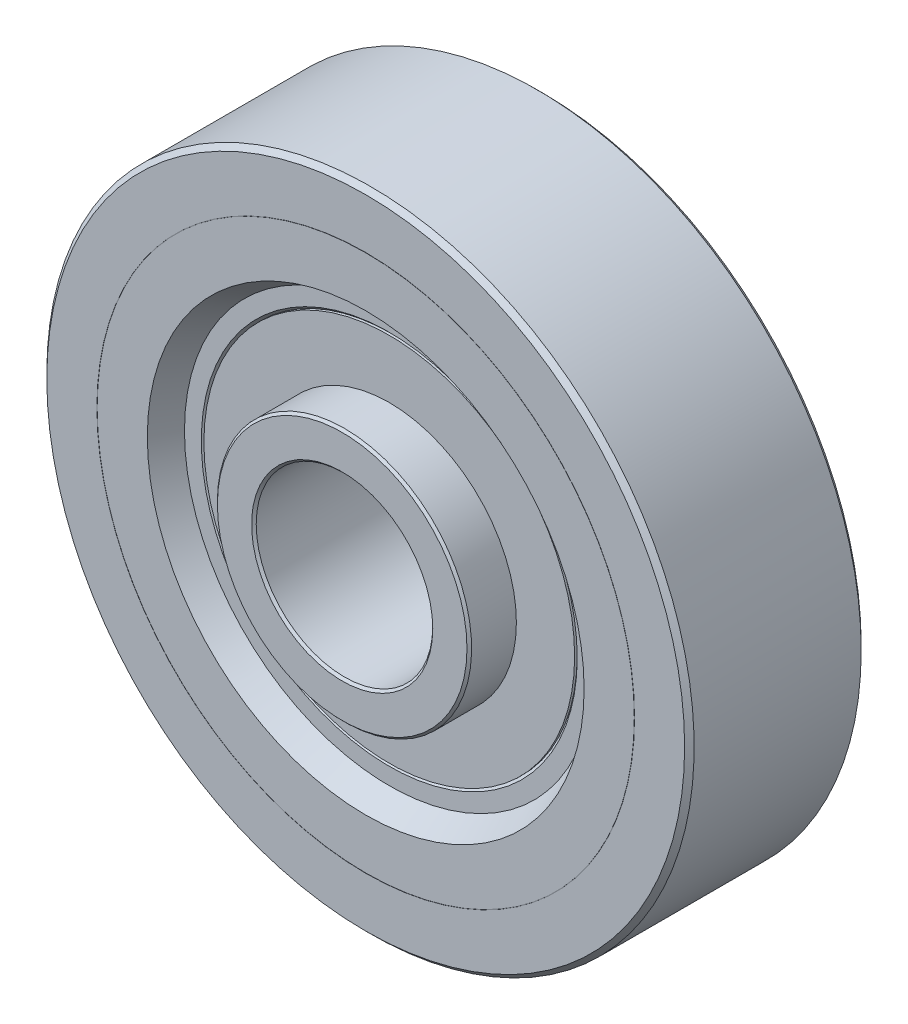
ISO-10303-21;
HEADER;
FILE_DESCRIPTION(('STEP AP214'),'2;1');
FILE_NAME('part.step','',(''),(''),'','','');
FILE_SCHEMA(('AUTOMOTIVE_DESIGN { 1 0 10303 214 1 1 1 1 }'));
ENDSEC;
DATA;
#1=APPLICATION_CONTEXT('core data for automotive mechanical design processes');
#2=APPLICATION_PROTOCOL_DEFINITION('international standard','automotive_design',2000,#1);
#3=PRODUCT_CONTEXT('',#1,'mechanical');
#4=PRODUCT('Part','Part','',(#3));
#5=PRODUCT_RELATED_PRODUCT_CATEGORY('part','',(#4));
#6=PRODUCT_DEFINITION_FORMATION('','',#4);
#7=PRODUCT_DEFINITION_CONTEXT('part definition',#1,'design');
#8=PRODUCT_DEFINITION('design','',#6,#7);
#9=PRODUCT_DEFINITION_SHAPE('','',#8);
#10=(LENGTH_UNIT() NAMED_UNIT(*) SI_UNIT(.MILLI.,.METRE.));
#11=(NAMED_UNIT(*) PLANE_ANGLE_UNIT() SI_UNIT($,.RADIAN.));
#12=(NAMED_UNIT(*) SI_UNIT($,.STERADIAN.) SOLID_ANGLE_UNIT());
#13=UNCERTAINTY_MEASURE_WITH_UNIT(LENGTH_MEASURE(1.E-05),#10,'distance_accuracy_value','');
#14=(GEOMETRIC_REPRESENTATION_CONTEXT(3) GLOBAL_UNCERTAINTY_ASSIGNED_CONTEXT((#13)) GLOBAL_UNIT_ASSIGNED_CONTEXT((#10,
#11,#12)) REPRESENTATION_CONTEXT('',''));
#15=CARTESIAN_POINT('',(0.,0.,0.));
#16=DIRECTION('',(0.,0.,1.));
#17=DIRECTION('',(1.,0.,0.));
#18=AXIS2_PLACEMENT_3D('',#15,#16,#17);
#19=CARTESIAN_POINT('',(0.,13.275,5.5));
#20=DIRECTION('',(0.,0.,1.));
#21=DIRECTION('',(1.,0.,0.));
#22=AXIS2_PLACEMENT_3D('',#19,#20,#21);
#23=PLANE('',#22);
#24=CARTESIAN_POINT('',(0.,0.,5.5));
#25=DIRECTION('',(0.,0.,-1.));
#26=DIRECTION('',(-1.,0.,0.));
#27=AXIS2_PLACEMENT_3D('',#24,#25,#26);
#28=CIRCLE('',#27,15.75);
#29=CARTESIAN_POINT('',(-15.75,0.,5.5));
#30=VERTEX_POINT('',#29);
#31=EDGE_CURVE('E44',#30,#30,#28,.T.);
#32=ORIENTED_EDGE('',*,*,#31,.F.);
#33=EDGE_LOOP('',(#32));
#34=FACE_BOUND('',#33,.T.);
#35=CARTESIAN_POINT('',(0.,0.,5.5));
#36=DIRECTION('',(0.,0.,1.));
#37=DIRECTION('',(1.,0.,0.));
#38=AXIS2_PLACEMENT_3D('',#35,#36,#37);
#39=CIRCLE('',#38,10.8);
#40=CARTESIAN_POINT('',(10.8,0.,5.5));
#41=VERTEX_POINT('',#40);
#42=EDGE_CURVE('E8',#41,#41,#39,.F.);
#43=ORIENTED_EDGE('',*,*,#42,.T.);
#44=EDGE_LOOP('',(#43));
#45=FACE_BOUND('',#44,.T.);
#46=ADVANCED_FACE('F12',(#34,#45),#23,.T.);
#47=CARTESIAN_POINT('',(0.,0.,4.8125));
#48=DIRECTION('',(0.,0.,-1.));
#49=DIRECTION('',(-1.,0.,0.));
#50=AXIS2_PLACEMENT_3D('',#47,#48,#49);
#51=CYLINDRICAL_SURFACE('',#50,15.75);
#52=ORIENTED_EDGE('',*,*,#31,.T.);
#53=EDGE_LOOP('',(#52));
#54=FACE_BOUND('',#53,.T.);
#55=CARTESIAN_POINT('',(0.,0.,5.28));
#56=DIRECTION('',(0.,0.,1.));
#57=DIRECTION('',(0.,1.,0.));
#58=AXIS2_PLACEMENT_3D('',#55,#56,#57);
#59=CIRCLE('',#58,15.75);
#60=CARTESIAN_POINT('',(0.,15.75,5.28));
#61=VERTEX_POINT('',#60);
#62=EDGE_CURVE('E41',#61,#61,#59,.T.);
#63=ORIENTED_EDGE('',*,*,#62,.T.);
#64=EDGE_LOOP('',(#63));
#65=FACE_BOUND('',#64,.T.);
#66=ADVANCED_FACE('F192',(#54,#65),#51,.T.);
#67=CARTESIAN_POINT('',(0.,0.,5.5));
#68=DIRECTION('',(0.,0.,1.));
#69=DIRECTION('',(1.,0.,0.));
#70=AXIS2_PLACEMENT_3D('',#67,#68,#69);
#71=CONICAL_SURFACE('',#70,15.97,0.78539816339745);
#72=ORIENTED_EDGE('',*,*,#62,.F.);
#73=EDGE_LOOP('',(#72));
#74=FACE_BOUND('',#73,.T.);
#75=CARTESIAN_POINT('',(0.,0.,5.5));
#76=DIRECTION('',(0.,0.,1.));
#77=DIRECTION('',(1.,0.,0.));
#78=AXIS2_PLACEMENT_3D('',#75,#76,#77);
#79=CIRCLE('',#78,15.97);
#80=CARTESIAN_POINT('',(15.97,0.,5.5));
#81=VERTEX_POINT('',#80);
#82=EDGE_CURVE('E40',#81,#81,#79,.F.);
#83=ORIENTED_EDGE('',*,*,#82,.F.);
#84=EDGE_LOOP('',(#83));
#85=FACE_BOUND('',#84,.T.);
#86=ADVANCED_FACE('F187',(#74,#85),#71,.F.);
#87=CARTESIAN_POINT('',(0.,16.685,5.5));
#88=DIRECTION('',(0.,0.,1.));
#89=DIRECTION('',(1.,0.,0.));
#90=AXIS2_PLACEMENT_3D('',#87,#88,#89);
#91=PLANE('',#90);
#92=CARTESIAN_POINT('',(0.,0.,5.5));
#93=DIRECTION('',(0.,0.,1.));
#94=DIRECTION('',(1.,0.,0.));
#95=AXIS2_PLACEMENT_3D('',#92,#93,#94);
#96=CIRCLE('',#95,17.4);
#97=CARTESIAN_POINT('',(17.4,0.,5.5));
#98=VERTEX_POINT('',#97);
#99=EDGE_CURVE('E83',#98,#98,#96,.T.);
#100=ORIENTED_EDGE('',*,*,#99,.T.);
#101=EDGE_LOOP('',(#100));
#102=FACE_BOUND('',#101,.T.);
#103=ORIENTED_EDGE('',*,*,#82,.T.);
#104=EDGE_LOOP('',(#103));
#105=FACE_BOUND('',#104,.T.);
#106=ADVANCED_FACE('F181',(#102,#105),#91,.T.);
#107=CARTESIAN_POINT('',(0.,0.,7.5));
#108=DIRECTION('',(0.,0.,1.));
#109=DIRECTION('',(1.,0.,0.));
#110=AXIS2_PLACEMENT_3D('',#107,#108,#109);
#111=CONICAL_SURFACE('',#110,18.5547005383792,0.523598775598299);
#112=ORIENTED_EDGE('',*,*,#99,.F.);
#113=EDGE_LOOP('',(#112));
#114=FACE_BOUND('',#113,.T.);
#115=CARTESIAN_POINT('',(0.,0.,7.5));
#116=DIRECTION('',(0.,0.,1.));
#117=DIRECTION('',(1.,0.,0.));
#118=AXIS2_PLACEMENT_3D('',#115,#116,#117);
#119=CIRCLE('',#118,18.5547005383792);
#120=CARTESIAN_POINT('',(18.5547005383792,0.,7.5));
#121=VERTEX_POINT('',#120);
#122=EDGE_CURVE('E77',#121,#121,#119,.F.);
#123=ORIENTED_EDGE('',*,*,#122,.F.);
#124=EDGE_LOOP('',(#123));
#125=FACE_BOUND('',#124,.T.);
#126=ADVANCED_FACE('F174',(#114,#125),#111,.F.);
#127=CARTESIAN_POINT('',(0.,20.6866002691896,7.5));
#128=DIRECTION('',(0.,0.,1.));
#129=DIRECTION('',(1.,0.,0.));
#130=AXIS2_PLACEMENT_3D('',#127,#128,#129);
#131=PLANE('',#130);
#132=CARTESIAN_POINT('',(0.,0.,7.5));
#133=DIRECTION('',(0.,0.,-1.));
#134=DIRECTION('',(-1.,0.,0.));
#135=AXIS2_PLACEMENT_3D('',#132,#133,#134);
#136=CIRCLE('',#135,22.8185);
#137=CARTESIAN_POINT('',(-22.8185,0.,7.5));
#138=VERTEX_POINT('',#137);
#139=EDGE_CURVE('E71',#138,#138,#136,.T.);
#140=ORIENTED_EDGE('',*,*,#139,.F.);
#141=EDGE_LOOP('',(#140));
#142=FACE_BOUND('',#141,.T.);
#143=ORIENTED_EDGE('',*,*,#122,.T.);
#144=EDGE_LOOP('',(#143));
#145=FACE_BOUND('',#144,.T.);
#146=ADVANCED_FACE('F166',(#142,#145),#131,.T.);
#147=CARTESIAN_POINT('',(0.,0.,7.49));
#148=DIRECTION('',(0.,0.,-1.));
#149=DIRECTION('',(-1.,0.,0.));
#150=AXIS2_PLACEMENT_3D('',#147,#148,#149);
#151=CYLINDRICAL_SURFACE('',#150,22.8185);
#152=ORIENTED_EDGE('',*,*,#139,.T.);
#153=EDGE_LOOP('',(#152));
#154=FACE_BOUND('',#153,.T.);
#155=CARTESIAN_POINT('',(0.,0.,7.48));
#156=DIRECTION('',(0.,0.,-1.));
#157=DIRECTION('',(-1.,0.,0.));
#158=AXIS2_PLACEMENT_3D('',#155,#156,#157);
#159=CIRCLE('',#158,22.8185);
#160=CARTESIAN_POINT('',(-22.8185,0.,7.48));
#161=VERTEX_POINT('',#160);
#162=EDGE_CURVE('E65',#161,#161,#159,.T.);
#163=ORIENTED_EDGE('',*,*,#162,.F.);
#164=EDGE_LOOP('',(#163));
#165=FACE_BOUND('',#164,.T.);
#166=ADVANCED_FACE('F158',(#154,#165),#151,.T.);
#167=CARTESIAN_POINT('',(0.,22.8285,7.48));
#168=DIRECTION('',(0.,0.,1.));
#169=DIRECTION('',(1.,0.,0.));
#170=AXIS2_PLACEMENT_3D('',#167,#168,#169);
#171=PLANE('',#170);
#172=CARTESIAN_POINT('',(0.,0.,7.48));
#173=DIRECTION('',(0.,0.,-1.));
#174=DIRECTION('',(-1.,0.,0.));
#175=AXIS2_PLACEMENT_3D('',#172,#173,#174);
#176=CIRCLE('',#175,22.8385);
#177=CARTESIAN_POINT('',(-22.8385,0.,7.48));
#178=VERTEX_POINT('',#177);
#179=EDGE_CURVE('E59',#178,#178,#176,.F.);
#180=ORIENTED_EDGE('',*,*,#179,.T.);
#181=EDGE_LOOP('',(#180));
#182=FACE_BOUND('',#181,.T.);
#183=ORIENTED_EDGE('',*,*,#162,.T.);
#184=EDGE_LOOP('',(#183));
#185=FACE_BOUND('',#184,.T.);
#186=ADVANCED_FACE('F150',(#182,#185),#171,.T.);
#187=CARTESIAN_POINT('',(0.,0.,7.49));
#188=DIRECTION('',(0.,0.,-1.));
#189=DIRECTION('',(-1.,0.,0.));
#190=AXIS2_PLACEMENT_3D('',#187,#188,#189);
#191=CYLINDRICAL_SURFACE('',#190,22.8385);
#192=ORIENTED_EDGE('',*,*,#179,.F.);
#193=EDGE_LOOP('',(#192));
#194=FACE_BOUND('',#193,.T.);
#195=CARTESIAN_POINT('',(0.,0.,7.5));
#196=DIRECTION('',(0.,0.,-1.));
#197=DIRECTION('',(-1.,0.,0.));
#198=AXIS2_PLACEMENT_3D('',#195,#196,#197);
#199=CIRCLE('',#198,22.8385);
#200=CARTESIAN_POINT('',(-22.8385,0.,7.5));
#201=VERTEX_POINT('',#200);
#202=EDGE_CURVE('E53',#201,#201,#199,.T.);
#203=ORIENTED_EDGE('',*,*,#202,.F.);
#204=EDGE_LOOP('',(#203));
#205=FACE_BOUND('',#204,.T.);
#206=ADVANCED_FACE('F142',(#194,#205),#191,.F.);
#207=CARTESIAN_POINT('',(0.,24.9670441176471,7.5));
#208=DIRECTION('',(0.,0.,1.));
#209=DIRECTION('',(1.,0.,0.));
#210=AXIS2_PLACEMENT_3D('',#207,#208,#209);
#211=PLANE('',#210);
#212=CARTESIAN_POINT('',(0.,0.,7.5));
#213=DIRECTION('',(0.,0.,-1.));
#214=DIRECTION('',(-1.,0.,0.));
#215=AXIS2_PLACEMENT_3D('',#212,#213,#214);
#216=CIRCLE('',#215,27.0955882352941);
#217=CARTESIAN_POINT('',(-27.0955882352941,0.,7.5));
#218=VERTEX_POINT('',#217);
#219=EDGE_CURVE('E47',#218,#218,#216,.T.);
#220=ORIENTED_EDGE('',*,*,#219,.F.);
#221=EDGE_LOOP('',(#220));
#222=FACE_BOUND('',#221,.T.);
#223=ORIENTED_EDGE('',*,*,#202,.T.);
#224=EDGE_LOOP('',(#223));
#225=FACE_BOUND('',#224,.T.);
#226=ADVANCED_FACE('F134',(#222,#225),#211,.T.);
#227=CARTESIAN_POINT('',(0.,0.,7.09558823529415));
#228=DIRECTION('',(0.,0.,-1.));
#229=DIRECTION('',(-1.,0.,0.));
#230=AXIS2_PLACEMENT_3D('',#227,#228,#229);
#231=CONICAL_SURFACE('',#230,27.5,0.78539816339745);
#232=ORIENTED_EDGE('',*,*,#219,.T.);
#233=EDGE_LOOP('',(#232));
#234=FACE_BOUND('',#233,.T.);
#235=CARTESIAN_POINT('',(0.,0.,7.0955882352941));
#236=DIRECTION('',(0.,0.,-1.));
#237=DIRECTION('',(-1.,0.,0.));
#238=AXIS2_PLACEMENT_3D('',#235,#236,#237);
#239=CIRCLE('',#238,27.5);
#240=CARTESIAN_POINT('',(-27.5,0.,7.0955882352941));
#241=VERTEX_POINT('',#240);
#242=EDGE_CURVE('E29',#241,#241,#239,.T.);
#243=ORIENTED_EDGE('',*,*,#242,.F.);
#244=EDGE_LOOP('',(#243));
#245=FACE_BOUND('',#244,.T.);
#246=ADVANCED_FACE('F110',(#234,#245),#231,.T.);
#247=CARTESIAN_POINT('',(0.,13.275,-5.5));
#248=DIRECTION('',(0.,0.,-1.));
#249=DIRECTION('',(-1.,0.,0.));
#250=AXIS2_PLACEMENT_3D('',#247,#248,#249);
#251=PLANE('',#250);
#252=CARTESIAN_POINT('',(0.,0.,-5.5));
#253=DIRECTION('',(0.,0.,-1.));
#254=DIRECTION('',(-1.,0.,0.));
#255=AXIS2_PLACEMENT_3D('',#252,#253,#254);
#256=CIRCLE('',#255,10.8);
#257=CARTESIAN_POINT('',(-10.8,0.,-5.5));
#258=VERTEX_POINT('',#257);
#259=EDGE_CURVE('E20',#258,#258,#256,.F.);
#260=ORIENTED_EDGE('',*,*,#259,.T.);
#261=EDGE_LOOP('',(#260));
#262=FACE_BOUND('',#261,.T.);
#263=CARTESIAN_POINT('',(0.,0.,-5.5));
#264=DIRECTION('',(0.,0.,-1.));
#265=DIRECTION('',(-1.,0.,0.));
#266=AXIS2_PLACEMENT_3D('',#263,#264,#265);
#267=CIRCLE('',#266,15.75);
#268=CARTESIAN_POINT('',(-15.75,0.,-5.5));
#269=VERTEX_POINT('',#268);
#270=EDGE_CURVE('E16',#269,#269,#267,.T.);
#271=ORIENTED_EDGE('',*,*,#270,.T.);
#272=EDGE_LOOP('',(#271));
#273=FACE_BOUND('',#272,.T.);
#274=ADVANCED_FACE('F96',(#262,#273),#251,.T.);
#275=CARTESIAN_POINT('',(0.,0.,-4.8125));
#276=DIRECTION('',(0.,0.,-1.));
#277=DIRECTION('',(-1.,0.,0.));
#278=AXIS2_PLACEMENT_3D('',#275,#276,#277);
#279=CYLINDRICAL_SURFACE('',#278,15.75);
#280=CARTESIAN_POINT('',(0.,0.,-5.28));
#281=DIRECTION('',(0.,0.,-1.));
#282=DIRECTION('',(0.,1.,0.));
#283=AXIS2_PLACEMENT_3D('',#280,#281,#282);
#284=CIRCLE('',#283,15.75);
#285=CARTESIAN_POINT('',(0.,15.75,-5.28));
#286=VERTEX_POINT('',#285);
#287=EDGE_CURVE('E37',#286,#286,#284,.T.);
#288=ORIENTED_EDGE('',*,*,#287,.T.);
#289=EDGE_LOOP('',(#288));
#290=FACE_BOUND('',#289,.T.);
#291=ORIENTED_EDGE('',*,*,#270,.F.);
#292=EDGE_LOOP('',(#291));
#293=FACE_BOUND('',#292,.T.);
#294=ADVANCED_FACE('F14',(#290,#293),#279,.T.);
#295=CARTESIAN_POINT('',(0.,0.,-5.5));
#296=DIRECTION('',(0.,0.,-1.));
#297=DIRECTION('',(-1.,0.,0.));
#298=AXIS2_PLACEMENT_3D('',#295,#296,#297);
#299=CONICAL_SURFACE('',#298,15.97,0.785398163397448);
#300=CARTESIAN_POINT('',(0.,0.,-5.5));
#301=DIRECTION('',(0.,0.,-1.));
#302=DIRECTION('',(-1.,0.,0.));
#303=AXIS2_PLACEMENT_3D('',#300,#301,#302);
#304=CIRCLE('',#303,15.97);
#305=CARTESIAN_POINT('',(-15.97,0.,-5.5));
#306=VERTEX_POINT('',#305);
#307=EDGE_CURVE('E86',#306,#306,#304,.F.);
#308=ORIENTED_EDGE('',*,*,#307,.F.);
#309=EDGE_LOOP('',(#308));
#310=FACE_BOUND('',#309,.T.);
#311=ORIENTED_EDGE('',*,*,#287,.F.);
#312=EDGE_LOOP('',(#311));
#313=FACE_BOUND('',#312,.T.);
#314=ADVANCED_FACE('F99',(#310,#313),#299,.F.);
#315=CARTESIAN_POINT('',(0.,16.685,-5.5));
#316=DIRECTION('',(0.,0.,-1.));
#317=DIRECTION('',(-1.,0.,0.));
#318=AXIS2_PLACEMENT_3D('',#315,#316,#317);
#319=PLANE('',#318);
#320=ORIENTED_EDGE('',*,*,#307,.T.);
#321=EDGE_LOOP('',(#320));
#322=FACE_BOUND('',#321,.T.);
#323=CARTESIAN_POINT('',(0.,0.,-5.5));
#324=DIRECTION('',(0.,0.,-1.));
#325=DIRECTION('',(-1.,0.,0.));
#326=AXIS2_PLACEMENT_3D('',#323,#324,#325);
#327=CIRCLE('',#326,17.4);
#328=CARTESIAN_POINT('',(-17.4,0.,-5.5));
#329=VERTEX_POINT('',#328);
#330=EDGE_CURVE('E80',#329,#329,#327,.T.);
#331=ORIENTED_EDGE('',*,*,#330,.T.);
#332=EDGE_LOOP('',(#331));
#333=FACE_BOUND('',#332,.T.);
#334=ADVANCED_FACE('F107',(#322,#333),#319,.T.);
#335=CARTESIAN_POINT('',(0.,0.,-7.5));
#336=DIRECTION('',(0.,0.,-1.));
#337=DIRECTION('',(-1.,0.,0.));
#338=AXIS2_PLACEMENT_3D('',#335,#336,#337);
#339=CONICAL_SURFACE('',#338,18.5547005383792,0.523598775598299);
#340=CARTESIAN_POINT('',(0.,0.,-7.5));
#341=DIRECTION('',(0.,0.,-1.));
#342=DIRECTION('',(-1.,0.,0.));
#343=AXIS2_PLACEMENT_3D('',#340,#341,#342);
#344=CIRCLE('',#343,18.5547005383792);
#345=CARTESIAN_POINT('',(-18.5547005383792,0.,-7.5));
#346=VERTEX_POINT('',#345);
#347=EDGE_CURVE('E74',#346,#346,#344,.F.);
#348=ORIENTED_EDGE('',*,*,#347,.F.);
#349=EDGE_LOOP('',(#348));
#350=FACE_BOUND('',#349,.T.);
#351=ORIENTED_EDGE('',*,*,#330,.F.);
#352=EDGE_LOOP('',(#351));
#353=FACE_BOUND('',#352,.T.);
#354=ADVANCED_FACE('F170',(#350,#353),#339,.F.);
#355=CARTESIAN_POINT('',(0.,20.6866002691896,-7.5));
#356=DIRECTION('',(0.,0.,-1.));
#357=DIRECTION('',(-1.,0.,0.));
#358=AXIS2_PLACEMENT_3D('',#355,#356,#357);
#359=PLANE('',#358);
#360=ORIENTED_EDGE('',*,*,#347,.T.);
#361=EDGE_LOOP('',(#360));
#362=FACE_BOUND('',#361,.T.);
#363=CARTESIAN_POINT('',(0.,0.,-7.5));
#364=DIRECTION('',(0.,0.,-1.));
#365=DIRECTION('',(-1.,0.,0.));
#366=AXIS2_PLACEMENT_3D('',#363,#364,#365);
#367=CIRCLE('',#366,22.8185);
#368=CARTESIAN_POINT('',(-22.8185,0.,-7.5));
#369=VERTEX_POINT('',#368);
#370=EDGE_CURVE('E68',#369,#369,#367,.F.);
#371=ORIENTED_EDGE('',*,*,#370,.F.);
#372=EDGE_LOOP('',(#371));
#373=FACE_BOUND('',#372,.T.);
#374=ADVANCED_FACE('F162',(#362,#373),#359,.T.);
#375=CARTESIAN_POINT('',(0.,0.,-7.49));
#376=DIRECTION('',(0.,0.,-1.));
#377=DIRECTION('',(-1.,0.,0.));
#378=AXIS2_PLACEMENT_3D('',#375,#376,#377);
#379=CYLINDRICAL_SURFACE('',#378,22.8185);
#380=CARTESIAN_POINT('',(0.,0.,-7.48));
#381=DIRECTION('',(0.,0.,-1.));
#382=DIRECTION('',(-1.,0.,0.));
#383=AXIS2_PLACEMENT_3D('',#380,#381,#382);
#384=CIRCLE('',#383,22.8185);
#385=CARTESIAN_POINT('',(-22.8185,0.,-7.48));
#386=VERTEX_POINT('',#385);
#387=EDGE_CURVE('E62',#386,#386,#384,.F.);
#388=ORIENTED_EDGE('',*,*,#387,.F.);
#389=EDGE_LOOP('',(#388));
#390=FACE_BOUND('',#389,.T.);
#391=ORIENTED_EDGE('',*,*,#370,.T.);
#392=EDGE_LOOP('',(#391));
#393=FACE_BOUND('',#392,.T.);
#394=ADVANCED_FACE('F154',(#390,#393),#379,.T.);
#395=CARTESIAN_POINT('',(0.,22.8285,-7.48));
#396=DIRECTION('',(0.,0.,-1.));
#397=DIRECTION('',(-1.,0.,0.));
#398=AXIS2_PLACEMENT_3D('',#395,#396,#397);
#399=PLANE('',#398);
#400=ORIENTED_EDGE('',*,*,#387,.T.);
#401=EDGE_LOOP('',(#400));
#402=FACE_BOUND('',#401,.T.);
#403=CARTESIAN_POINT('',(0.,0.,-7.48));
#404=DIRECTION('',(0.,0.,-1.));
#405=DIRECTION('',(-1.,0.,0.));
#406=AXIS2_PLACEMENT_3D('',#403,#404,#405);
#407=CIRCLE('',#406,22.8385);
#408=CARTESIAN_POINT('',(-22.8385,0.,-7.48));
#409=VERTEX_POINT('',#408);
#410=EDGE_CURVE('E56',#409,#409,#407,.T.);
#411=ORIENTED_EDGE('',*,*,#410,.T.);
#412=EDGE_LOOP('',(#411));
#413=FACE_BOUND('',#412,.T.);
#414=ADVANCED_FACE('F146',(#402,#413),#399,.T.);
#415=CARTESIAN_POINT('',(0.,0.,-7.49));
#416=DIRECTION('',(0.,0.,-1.));
#417=DIRECTION('',(-1.,0.,0.));
#418=AXIS2_PLACEMENT_3D('',#415,#416,#417);
#419=CYLINDRICAL_SURFACE('',#418,22.8385);
#420=CARTESIAN_POINT('',(0.,0.,-7.5));
#421=DIRECTION('',(0.,0.,-1.));
#422=DIRECTION('',(-1.,0.,0.));
#423=AXIS2_PLACEMENT_3D('',#420,#421,#422);
#424=CIRCLE('',#423,22.8385);
#425=CARTESIAN_POINT('',(-22.8385,0.,-7.5));
#426=VERTEX_POINT('',#425);
#427=EDGE_CURVE('E50',#426,#426,#424,.F.);
#428=ORIENTED_EDGE('',*,*,#427,.F.);
#429=EDGE_LOOP('',(#428));
#430=FACE_BOUND('',#429,.T.);
#431=ORIENTED_EDGE('',*,*,#410,.F.);
#432=EDGE_LOOP('',(#431));
#433=FACE_BOUND('',#432,.T.);
#434=ADVANCED_FACE('F138',(#430,#433),#419,.F.);
#435=CARTESIAN_POINT('',(0.,24.9670441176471,-7.5));
#436=DIRECTION('',(0.,0.,-1.));
#437=DIRECTION('',(-1.,0.,0.));
#438=AXIS2_PLACEMENT_3D('',#435,#436,#437);
#439=PLANE('',#438);
#440=ORIENTED_EDGE('',*,*,#427,.T.);
#441=EDGE_LOOP('',(#440));
#442=FACE_BOUND('',#441,.T.);
#443=CARTESIAN_POINT('',(0.,0.,-7.5));
#444=DIRECTION('',(0.,0.,1.));
#445=DIRECTION('',(1.,0.,0.));
#446=AXIS2_PLACEMENT_3D('',#443,#444,#445);
#447=CIRCLE('',#446,27.0955882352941);
#448=CARTESIAN_POINT('',(27.0955882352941,0.,-7.5));
#449=VERTEX_POINT('',#448);
#450=EDGE_CURVE('E33',#449,#449,#447,.T.);
#451=ORIENTED_EDGE('',*,*,#450,.F.);
#452=EDGE_LOOP('',(#451));
#453=FACE_BOUND('',#452,.T.);
#454=ADVANCED_FACE('F126',(#442,#453),#439,.T.);
#455=CARTESIAN_POINT('',(0.,0.,-7.09558823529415));
#456=DIRECTION('',(0.,0.,1.));
#457=DIRECTION('',(1.,0.,0.));
#458=AXIS2_PLACEMENT_3D('',#455,#456,#457);
#459=CONICAL_SURFACE('',#458,27.5,0.785398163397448);
#460=ORIENTED_EDGE('',*,*,#450,.T.);
#461=EDGE_LOOP('',(#460));
#462=FACE_BOUND('',#461,.T.);
#463=CARTESIAN_POINT('',(0.,0.,-7.0955882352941));
#464=DIRECTION('',(0.,0.,-1.));
#465=DIRECTION('',(-1.,0.,0.));
#466=AXIS2_PLACEMENT_3D('',#463,#464,#465);
#467=CIRCLE('',#466,27.5);
#468=CARTESIAN_POINT('',(-27.5,0.,-7.0955882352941));
#469=VERTEX_POINT('',#468);
#470=EDGE_CURVE('E32',#469,#469,#467,.F.);
#471=ORIENTED_EDGE('',*,*,#470,.F.);
#472=EDGE_LOOP('',(#471));
#473=FACE_BOUND('',#472,.T.);
#474=ADVANCED_FACE('F115',(#462,#473),#459,.T.);
#475=CARTESIAN_POINT('',(0.,0.,0.));
#476=DIRECTION('',(0.,0.,-1.));
#477=DIRECTION('',(-1.,0.,0.));
#478=AXIS2_PLACEMENT_3D('',#475,#476,#477);
#479=CYLINDRICAL_SURFACE('',#478,27.5);
#480=ORIENTED_EDGE('',*,*,#242,.T.);
#481=EDGE_LOOP('',(#480));
#482=FACE_BOUND('',#481,.T.);
#483=ORIENTED_EDGE('',*,*,#470,.T.);
#484=EDGE_LOOP('',(#483));
#485=FACE_BOUND('',#484,.T.);
#486=ADVANCED_FACE('F112',(#482,#485),#479,.T.);
#487=CARTESIAN_POINT('',(0.,0.,5.25116678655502));
#488=DIRECTION('',(0.,0.,-1.));
#489=DIRECTION('',(-1.,0.,0.));
#490=AXIS2_PLACEMENT_3D('',#487,#488,#489);
#491=CYLINDRICAL_SURFACE('',#490,10.8);
#492=CARTESIAN_POINT('',(0.,0.,9.30363636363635));
#493=DIRECTION('',(0.,0.,-1.));
#494=DIRECTION('',(0.,1.,0.));
#495=AXIS2_PLACEMENT_3D('',#492,#493,#494);
#496=CIRCLE('',#495,10.8);
#497=CARTESIAN_POINT('',(0.,10.8,9.30363636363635));
#498=VERTEX_POINT('',#497);
#499=EDGE_CURVE('E36',#498,#498,#496,.F.);
#500=ORIENTED_EDGE('',*,*,#499,.F.);
#501=EDGE_LOOP('',(#500));
#502=FACE_BOUND('',#501,.T.);
#503=ORIENTED_EDGE('',*,*,#42,.F.);
#504=EDGE_LOOP('',(#503));
#505=FACE_BOUND('',#504,.T.);
#506=ADVANCED_FACE('F114',(#502,#505),#491,.T.);
#507=CARTESIAN_POINT('',(0.,0.,9.30363636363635));
#508=DIRECTION('',(0.,0.,-1.));
#509=DIRECTION('',(-1.,0.,0.));
#510=AXIS2_PLACEMENT_3D('',#507,#508,#509);
#511=CONICAL_SURFACE('',#510,10.8,0.785398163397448);
#512=CARTESIAN_POINT('',(0.,0.,9.5));
#513=DIRECTION('',(0.,0.,-1.));
#514=DIRECTION('',(-1.,0.,0.));
#515=AXIS2_PLACEMENT_3D('',#512,#513,#514);
#516=CIRCLE('',#515,10.6036363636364);
#517=CARTESIAN_POINT('',(-10.6036363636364,0.,9.5));
#518=VERTEX_POINT('',#517);
#519=EDGE_CURVE('E244',#518,#518,#516,.F.);
#520=ORIENTED_EDGE('',*,*,#519,.F.);
#521=EDGE_LOOP('',(#520));
#522=FACE_BOUND('',#521,.T.);
#523=ORIENTED_EDGE('',*,*,#499,.T.);
#524=EDGE_LOOP('',(#523));
#525=FACE_BOUND('',#524,.T.);
#526=ADVANCED_FACE('F123',(#522,#525),#511,.T.);
#527=CARTESIAN_POINT('',(0.,9.15,9.5));
#528=DIRECTION('',(0.,0.,1.));
#529=DIRECTION('',(1.,0.,0.));
#530=AXIS2_PLACEMENT_3D('',#527,#528,#529);
#531=PLANE('',#530);
#532=ORIENTED_EDGE('',*,*,#519,.T.);
#533=EDGE_LOOP('',(#532));
#534=FACE_BOUND('',#533,.T.);
#535=CARTESIAN_POINT('',(0.,0.,9.5));
#536=DIRECTION('',(0.,0.,1.));
#537=DIRECTION('',(1.,0.,0.));
#538=AXIS2_PLACEMENT_3D('',#535,#536,#537);
#539=CIRCLE('',#538,7.69636363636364);
#540=CARTESIAN_POINT('',(7.69636363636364,0.,9.5));
#541=VERTEX_POINT('',#540);
#542=EDGE_CURVE('E257',#541,#541,#539,.F.);
#543=ORIENTED_EDGE('',*,*,#542,.T.);
#544=EDGE_LOOP('',(#543));
#545=FACE_BOUND('',#544,.T.);
#546=ADVANCED_FACE('F220',(#534,#545),#531,.T.);
#547=CARTESIAN_POINT('',(0.,0.,9.5));
#548=DIRECTION('',(0.,0.,1.));
#549=DIRECTION('',(1.,0.,0.));
#550=AXIS2_PLACEMENT_3D('',#547,#548,#549);
#551=CONICAL_SURFACE('',#550,7.69636363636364,0.785398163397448);
#552=CARTESIAN_POINT('',(0.,0.,9.30363636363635));
#553=DIRECTION('',(0.,0.,-1.));
#554=DIRECTION('',(-1.,0.,0.));
#555=AXIS2_PLACEMENT_3D('',#552,#553,#554);
#556=CIRCLE('',#555,7.5);
#557=CARTESIAN_POINT('',(-7.5,0.,9.30363636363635));
#558=VERTEX_POINT('',#557);
#559=EDGE_CURVE('E256',#558,#558,#556,.T.);
#560=ORIENTED_EDGE('',*,*,#559,.T.);
#561=EDGE_LOOP('',(#560));
#562=FACE_BOUND('',#561,.T.);
#563=ORIENTED_EDGE('',*,*,#542,.F.);
#564=EDGE_LOOP('',(#563));
#565=FACE_BOUND('',#564,.T.);
#566=ADVANCED_FACE('F216',(#562,#565),#551,.F.);
#567=CARTESIAN_POINT('',(0.,0.,-5.251166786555));
#568=DIRECTION('',(0.,0.,-1.));
#569=DIRECTION('',(-1.,0.,0.));
#570=AXIS2_PLACEMENT_3D('',#567,#568,#569);
#571=CYLINDRICAL_SURFACE('',#570,10.8);
#572=ORIENTED_EDGE('',*,*,#259,.F.);
#573=EDGE_LOOP('',(#572));
#574=FACE_BOUND('',#573,.T.);
#575=CARTESIAN_POINT('',(0.,0.,-9.3036363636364));
#576=DIRECTION('',(0.,0.,1.));
#577=DIRECTION('',(0.,1.,0.));
#578=AXIS2_PLACEMENT_3D('',#575,#576,#577);
#579=CIRCLE('',#578,10.8);
#580=CARTESIAN_POINT('',(0.,10.8,-9.3036363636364));
#581=VERTEX_POINT('',#580);
#582=EDGE_CURVE('E243',#581,#581,#579,.F.);
#583=ORIENTED_EDGE('',*,*,#582,.F.);
#584=EDGE_LOOP('',(#583));
#585=FACE_BOUND('',#584,.T.);
#586=ADVANCED_FACE('F219',(#574,#585),#571,.T.);
#587=CARTESIAN_POINT('',(0.,0.,-9.3036363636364));
#588=DIRECTION('',(0.,0.,1.));
#589=DIRECTION('',(1.,0.,0.));
#590=AXIS2_PLACEMENT_3D('',#587,#588,#589);
#591=CONICAL_SURFACE('',#590,10.8,0.785398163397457);
#592=ORIENTED_EDGE('',*,*,#582,.T.);
#593=EDGE_LOOP('',(#592));
#594=FACE_BOUND('',#593,.T.);
#595=CARTESIAN_POINT('',(0.,0.,-9.5));
#596=DIRECTION('',(0.,0.,1.));
#597=DIRECTION('',(1.,0.,0.));
#598=AXIS2_PLACEMENT_3D('',#595,#596,#597);
#599=CIRCLE('',#598,10.6036363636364);
#600=CARTESIAN_POINT('',(10.6036363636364,0.,-9.5));
#601=VERTEX_POINT('',#600);
#602=EDGE_CURVE('E247',#601,#601,#599,.F.);
#603=ORIENTED_EDGE('',*,*,#602,.F.);
#604=EDGE_LOOP('',(#603));
#605=FACE_BOUND('',#604,.T.);
#606=ADVANCED_FACE('F224',(#594,#605),#591,.T.);
#607=CARTESIAN_POINT('',(0.,9.15,-9.5));
#608=DIRECTION('',(0.,0.,-1.));
#609=DIRECTION('',(-1.,0.,0.));
#610=AXIS2_PLACEMENT_3D('',#607,#608,#609);
#611=PLANE('',#610);
#612=CARTESIAN_POINT('',(0.,0.,-9.5));
#613=DIRECTION('',(0.,0.,-1.));
#614=DIRECTION('',(-1.,0.,0.));
#615=AXIS2_PLACEMENT_3D('',#612,#613,#614);
#616=CIRCLE('',#615,7.69636363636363);
#617=CARTESIAN_POINT('',(-7.69636363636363,0.,-9.5));
#618=VERTEX_POINT('',#617);
#619=EDGE_CURVE('E253',#618,#618,#616,.F.);
#620=ORIENTED_EDGE('',*,*,#619,.T.);
#621=EDGE_LOOP('',(#620));
#622=FACE_BOUND('',#621,.T.);
#623=ORIENTED_EDGE('',*,*,#602,.T.);
#624=EDGE_LOOP('',(#623));
#625=FACE_BOUND('',#624,.T.);
#626=ADVANCED_FACE('F210',(#622,#625),#611,.T.);
#627=CARTESIAN_POINT('',(0.,0.,-9.5));
#628=DIRECTION('',(0.,0.,-1.));
#629=DIRECTION('',(-1.,0.,0.));
#630=AXIS2_PLACEMENT_3D('',#627,#628,#629);
#631=CONICAL_SURFACE('',#630,7.69636363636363,0.78539816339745);
#632=ORIENTED_EDGE('',*,*,#619,.F.);
#633=EDGE_LOOP('',(#632));
#634=FACE_BOUND('',#633,.T.);
#635=CARTESIAN_POINT('',(0.,0.,-9.3036363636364));
#636=DIRECTION('',(0.,0.,-1.));
#637=DIRECTION('',(-1.,0.,0.));
#638=AXIS2_PLACEMENT_3D('',#635,#636,#637);
#639=CIRCLE('',#638,7.5);
#640=CARTESIAN_POINT('',(-7.5,0.,-9.3036363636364));
#641=VERTEX_POINT('',#640);
#642=EDGE_CURVE('E25',#641,#641,#639,.F.);
#643=ORIENTED_EDGE('',*,*,#642,.T.);
#644=EDGE_LOOP('',(#643));
#645=FACE_BOUND('',#644,.T.);
#646=ADVANCED_FACE('F203',(#634,#645),#631,.F.);
#647=CARTESIAN_POINT('',(0.,0.,0.));
#648=DIRECTION('',(0.,0.,-1.));
#649=DIRECTION('',(-1.,0.,0.));
#650=AXIS2_PLACEMENT_3D('',#647,#648,#649);
#651=CYLINDRICAL_SURFACE('',#650,7.5);
#652=ORIENTED_EDGE('',*,*,#642,.F.);
#653=EDGE_LOOP('',(#652));
#654=FACE_BOUND('',#653,.T.);
#655=ORIENTED_EDGE('',*,*,#559,.F.);
#656=EDGE_LOOP('',(#655));
#657=FACE_BOUND('',#656,.T.);
#658=ADVANCED_FACE('F198',(#654,#657),#651,.F.);
#659=CLOSED_SHELL('',(#46,#66,#86,#106,#126,#146,#166,#186,#206,#226,#246,#274,#294,#314,#334,
#354,#374,#394,#414,#434,#454,#474,#486,#506,#526,#546,#566,#586,#606,#626,#646,#658));
#660=MANIFOLD_SOLID_BREP('B1',#659);
#661=ADVANCED_BREP_SHAPE_REPRESENTATION('',(#18,#660),#14);
#662=SHAPE_DEFINITION_REPRESENTATION(#9,#661);
ENDSEC;
END-ISO-10303-21;
